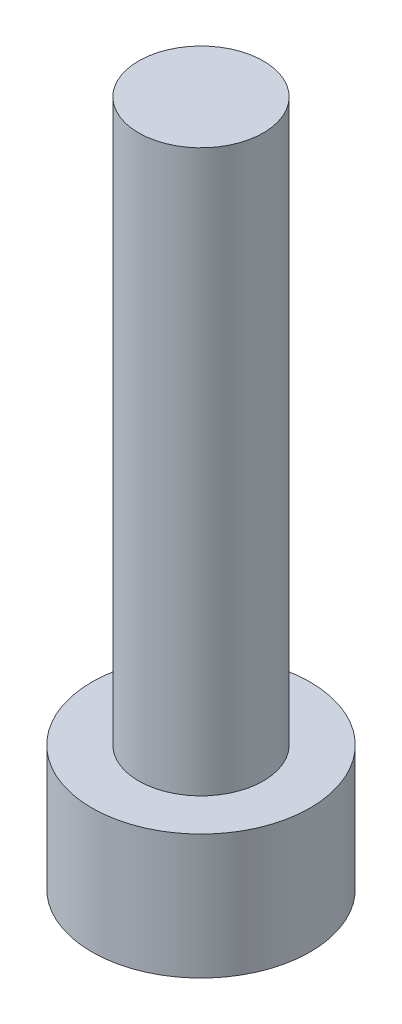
from build123d import *

# Parameters (mm, degrees)
SKETCH_1_R          = 3.5
EXTRUDE_1_DEPTH     = 4
SKETCH_2_R          = 2
EXTRUDE_2_DEPTH     = 18
CUT_EXTRUDE_1_DEPTH = 1.5


with BuildPart() as part:
    # Sketch 1 → Extrude 1 (new body)
    with BuildSketch(Plane(origin=(0, 0, 0), x_dir=(1, 0, 0), z_dir=(0, 1, 0))):
        with Locations(Location((0, 0, 0), (0, 0, 270))):
            Circle(SKETCH_1_R)
    extrude(amount=EXTRUDE_1_DEPTH)

    # Sketch 2 → Extrude 2 (add)
    with BuildSketch(Plane(origin=(0, 4, 0), x_dir=(1, 0, 0), z_dir=(0, 1, 0))):
        with Locations(Location((0, 0, 0), (0, 0, 270))):
            Circle(SKETCH_2_R)
    extrude(amount=EXTRUDE_2_DEPTH)

    # Sketch 3 → Cut-Extrude 1 (cut)
    with BuildSketch(Plane.XZ):
        Polygon((1.271315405, -1.17633207), (1.654391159, 0.512825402), (0.383075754, 1.689157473), (-1.271315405, 1.17633207), (-1.654391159, -0.512825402), (-0.383075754, -1.689157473), align=None)
    extrude(amount=-CUT_EXTRUDE_1_DEPTH, mode=Mode.SUBTRACT)


solid = part.part
